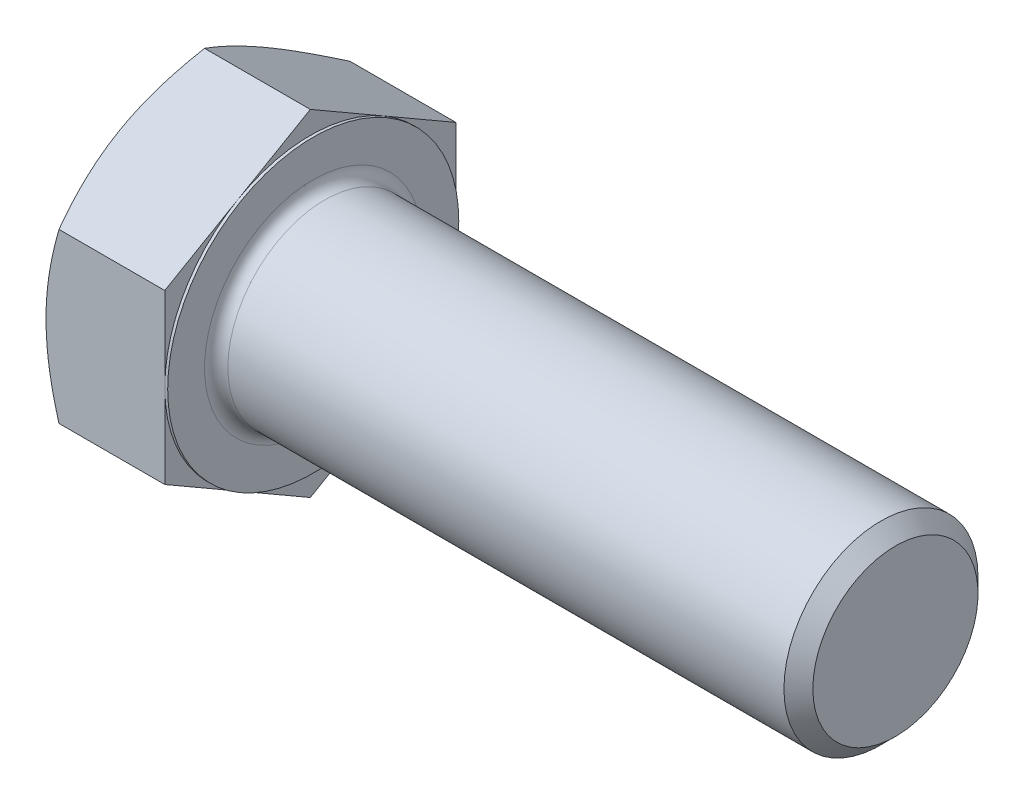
from build123d import *

# Parameters (mm, degrees)
BASEHEAD_DEPTH = 15.9258
SKETCH4_W      = 0.381
SKETCH4_H      = 28.347045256
HEADFILLET_R   = 1.524


with BuildPart() as part:
    # Sketch1 → BaseHead (new body)
    with BuildSketch(Plane(origin=(0, 0, 0), x_dir=(0, 0, -1), z_dir=(1, 0, 0))):
        Polygon((19.05, 10.998522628), (19.05, -10.998522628), (0, -21.997045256), (-19.05, -10.998522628), (-19.05, 10.998522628), (0, 21.997045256), align=None)
    extrude(amount=BASEHEAD_DEPTH)

    # BodySke → BaseBody (revolve)
    with BuildSketch(Plane.XY, mode=Mode.PRIVATE) as basebody_sk:
        Polygon((0, 0), (92.1258, 0), (92.1258, 10.8077), (90.2335, 12.7), (0, 12.7), align=None)
    revolve(basebody_sk.sketch.rotate(Axis((0, 0, 0), (1, 0, 0)), 90), axis=Axis((0, 0, 0), (1, 0, 0)))

    # Sketch3 → HeadChamfer (revolve, cut)
    with BuildSketch(Plane.XY):
        Polygon((0, 19.05), (5.367651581, 28.347045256), (5.367651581, 34.697045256), (-12.7, 34.697045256), (-12.7, 19.05), align=None)
    revolve(axis=Axis((0, 0, 0), (1, 0, 0)), mode=Mode.SUBTRACT)

    # Sketch4 → BearingFace (revolve, cut)
    with BuildSketch(Plane.XY, mode=Mode.PRIVATE) as bearingface_sk:
        with Locations((15.7353, 33.223522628)):
            Rectangle(SKETCH4_W, SKETCH4_H)
    revolve(bearingface_sk.sketch.rotate(Axis((0, 0, 0), (1, 0, 0)), 270), axis=Axis((0, 0, 0), (1, 0, 0)), mode=Mode.SUBTRACT)

    # HeadFillet
    headfillet_edges = [part.edges().sort_by_distance(p)[0] for p in [
        (15.9258, 0, -12.7),
    ]]
    fillet(headfillet_edges, radius=HEADFILLET_R)


solid = part.part
